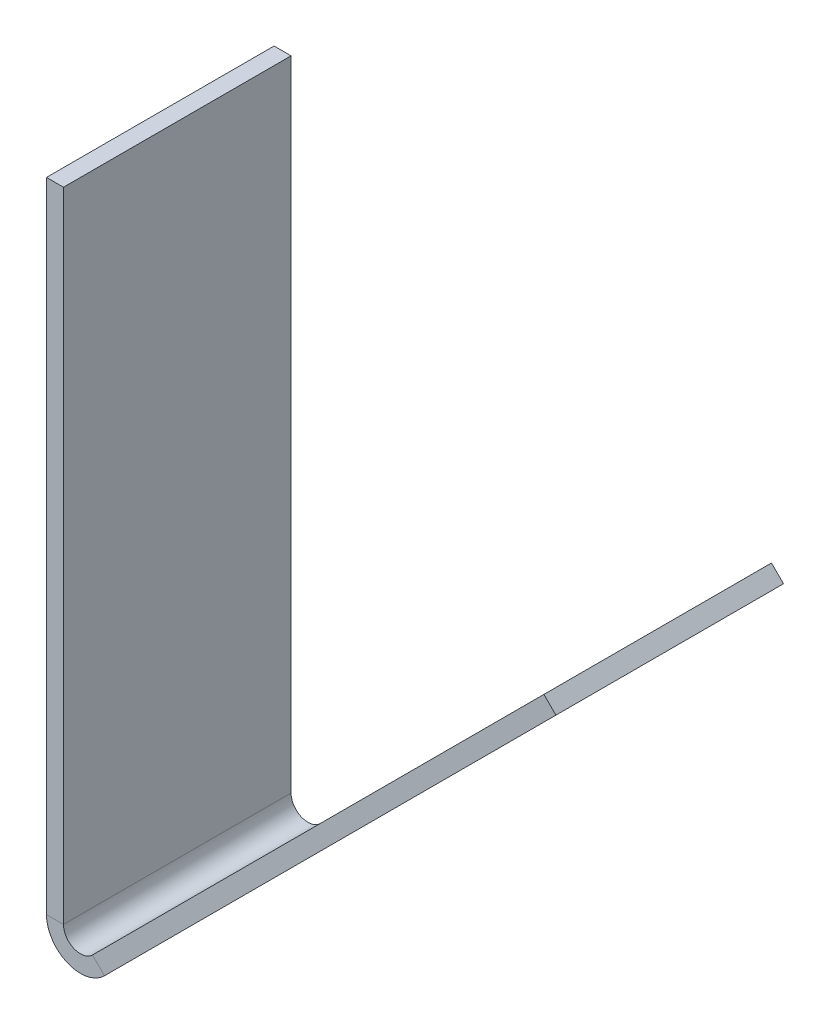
ISO-10303-21;
HEADER;
FILE_DESCRIPTION(('STEP AP214'),'2;1');
FILE_NAME('part.step','',(''),(''),'','','');
FILE_SCHEMA(('AUTOMOTIVE_DESIGN { 1 0 10303 214 1 1 1 1 }'));
ENDSEC;
DATA;
#1=APPLICATION_CONTEXT('core data for automotive mechanical design processes');
#2=APPLICATION_PROTOCOL_DEFINITION('international standard','automotive_design',2000,#1);
#3=PRODUCT_CONTEXT('',#1,'mechanical');
#4=PRODUCT('Part','Part','',(#3));
#5=PRODUCT_RELATED_PRODUCT_CATEGORY('part','',(#4));
#6=PRODUCT_DEFINITION_FORMATION('','',#4);
#7=PRODUCT_DEFINITION_CONTEXT('part definition',#1,'design');
#8=PRODUCT_DEFINITION('design','',#6,#7);
#9=PRODUCT_DEFINITION_SHAPE('','',#8);
#10=(LENGTH_UNIT() NAMED_UNIT(*) SI_UNIT(.MILLI.,.METRE.));
#11=(NAMED_UNIT(*) PLANE_ANGLE_UNIT() SI_UNIT($,.RADIAN.));
#12=(NAMED_UNIT(*) SI_UNIT($,.STERADIAN.) SOLID_ANGLE_UNIT());
#13=UNCERTAINTY_MEASURE_WITH_UNIT(LENGTH_MEASURE(1.E-05),#10,'distance_accuracy_value','');
#14=(GEOMETRIC_REPRESENTATION_CONTEXT(3) GLOBAL_UNCERTAINTY_ASSIGNED_CONTEXT((#13)) GLOBAL_UNIT_ASSIGNED_CONTEXT((#10,
#11,#12)) REPRESENTATION_CONTEXT('',''));
#15=CARTESIAN_POINT('',(0.,0.,0.));
#16=DIRECTION('',(0.,0.,1.));
#17=DIRECTION('',(1.,0.,0.));
#18=AXIS2_PLACEMENT_3D('',#15,#16,#17);
#19=CARTESIAN_POINT('',(4.26776695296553,4.26776695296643,33.4999999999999));
#20=DIRECTION('',(0.,0.,0.999999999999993));
#21=DIRECTION('',(0.999999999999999,0.,0.));
#22=AXIS2_PLACEMENT_3D('',#19,#20,#21);
#23=PLANE('',#22);
#24=DIRECTION('',(0.707106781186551,-0.707106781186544,0.));
#25=VECTOR('',#24,1.);
#26=CARTESIAN_POINT('',(4.26776695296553,4.26776695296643,33.4999999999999));
#27=LINE('',#26,#25);
#28=CARTESIAN_POINT('',(4.26776695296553,4.26776695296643,33.4999999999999));
#29=VERTEX_POINT('',#28);
#30=CARTESIAN_POINT('',(6.03553390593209,2.50000000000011,33.4999999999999));
#31=VERTEX_POINT('',#30);
#32=EDGE_CURVE('E11',#29,#31,#27,.T.);
#33=ORIENTED_EDGE('',*,*,#32,.F.);
#34=CARTESIAN_POINT('',(2.49999999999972,6.03553390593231,33.4999999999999));
#35=DIRECTION('',(0.,0.,-0.999999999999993));
#36=DIRECTION('',(-0.999999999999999,0.,0.));
#37=AXIS2_PLACEMENT_3D('',#34,#35,#36);
#38=CIRCLE('',#37,2.5);
#39=CARTESIAN_POINT('',(0.,6.03553390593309,33.4999999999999));
#40=VERTEX_POINT('',#39);
#41=EDGE_CURVE('E161',#40,#29,#38,.F.);
#42=ORIENTED_EDGE('',*,*,#41,.F.);
#43=DIRECTION('',(0.999999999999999,0.,0.));
#44=VECTOR('',#43,1.);
#45=CARTESIAN_POINT('',(-2.50000000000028,6.03553390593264,33.4999999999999));
#46=LINE('',#45,#44);
#47=CARTESIAN_POINT('',(-2.50000000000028,6.03553390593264,33.4999999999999));
#48=VERTEX_POINT('',#47);
#49=EDGE_CURVE('E46',#48,#40,#46,.T.);
#50=ORIENTED_EDGE('',*,*,#49,.F.);
#51=CARTESIAN_POINT('',(2.49999999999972,6.03553390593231,33.4999999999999));
#52=DIRECTION('',(0.,0.,0.999999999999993));
#53=DIRECTION('',(0.999999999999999,0.,0.));
#54=AXIS2_PLACEMENT_3D('',#51,#52,#53);
#55=CIRCLE('',#54,5.);
#56=EDGE_CURVE('E176',#48,#31,#55,.T.);
#57=ORIENTED_EDGE('',*,*,#56,.T.);
#58=EDGE_LOOP('',(#33,#42,#50,#57));
#59=FACE_BOUND('',#58,.T.);
#60=ADVANCED_FACE('F38',(#59),#23,.T.);
#61=CARTESIAN_POINT('',(-2.50000000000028,6.03553390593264,33.4999999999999));
#62=DIRECTION('',(0.,0.,0.999999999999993));
#63=DIRECTION('',(0.999999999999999,0.,0.));
#64=AXIS2_PLACEMENT_3D('',#61,#62,#63);
#65=PLANE('',#64);
#66=DIRECTION('',(0.707106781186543,0.707106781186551,0.));
#67=VECTOR('',#66,1.);
#68=CARTESIAN_POINT('',(0.,0.,33.4999999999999));
#69=LINE('',#68,#67);
#70=CARTESIAN_POINT('',(70.7106781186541,70.7106781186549,33.4999999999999));
#71=VERTEX_POINT('',#70);
#72=EDGE_CURVE('E157',#29,#71,#69,.T.);
#73=ORIENTED_EDGE('',*,*,#72,.F.);
#74=ORIENTED_EDGE('',*,*,#32,.T.);
#75=DIRECTION('',(0.707106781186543,0.707106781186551,0.));
#76=VECTOR('',#75,1.);
#77=CARTESIAN_POINT('',(1.7677669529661,-1.76776695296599,33.4999999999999));
#78=LINE('',#77,#76);
#79=CARTESIAN_POINT('',(72.4784450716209,68.9429111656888,33.4999999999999));
#80=VERTEX_POINT('',#79);
#81=EDGE_CURVE('E153',#31,#80,#78,.T.);
#82=ORIENTED_EDGE('',*,*,#81,.T.);
#83=DIRECTION('',(0.707106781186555,-0.707106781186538,0.));
#84=VECTOR('',#83,1.);
#85=CARTESIAN_POINT('',(70.7106781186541,70.7106781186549,33.4999999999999));
#86=LINE('',#85,#84);
#87=EDGE_CURVE('E108',#71,#80,#86,.T.);
#88=ORIENTED_EDGE('',*,*,#87,.F.);
#89=EDGE_LOOP('',(#73,#74,#82,#88));
#90=FACE_BOUND('',#89,.T.);
#91=ADVANCED_FACE('F230',(#90),#65,.T.);
#92=CARTESIAN_POINT('',(0.,6.0355339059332,0.));
#93=DIRECTION('',(0.,0.,-0.999999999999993));
#94=DIRECTION('',(-0.999999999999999,0.,0.));
#95=AXIS2_PLACEMENT_3D('',#92,#93,#94);
#96=PLANE('',#95);
#97=DIRECTION('',(-0.999999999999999,0.,0.));
#98=VECTOR('',#97,1.);
#99=CARTESIAN_POINT('',(0.,6.0355339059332,0.));
#100=LINE('',#99,#98);
#101=CARTESIAN_POINT('',(0.,6.0355339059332,0.));
#102=VERTEX_POINT('',#101);
#103=CARTESIAN_POINT('',(-2.50000000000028,6.03553390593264,0.));
#104=VERTEX_POINT('',#103);
#105=EDGE_CURVE('E203',#102,#104,#100,.T.);
#106=ORIENTED_EDGE('',*,*,#105,.F.);
#107=CARTESIAN_POINT('',(2.49999999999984,6.03553390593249,0.));
#108=DIRECTION('',(0.,0.,-0.999999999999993));
#109=DIRECTION('',(-0.999999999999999,0.,0.));
#110=AXIS2_PLACEMENT_3D('',#107,#108,#109);
#111=CIRCLE('',#110,2.5);
#112=CARTESIAN_POINT('',(4.26776695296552,4.26776695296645,0.));
#113=VERTEX_POINT('',#112);
#114=EDGE_CURVE('E131',#102,#113,#111,.F.);
#115=ORIENTED_EDGE('',*,*,#114,.T.);
#116=DIRECTION('',(-0.707106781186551,0.707106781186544,0.));
#117=VECTOR('',#116,1.);
#118=CARTESIAN_POINT('',(6.03553390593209,2.50000000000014,0.));
#119=LINE('',#118,#117);
#120=CARTESIAN_POINT('',(6.03553390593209,2.50000000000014,0.));
#121=VERTEX_POINT('',#120);
#122=EDGE_CURVE('E112',#121,#113,#119,.T.);
#123=ORIENTED_EDGE('',*,*,#122,.F.);
#124=CARTESIAN_POINT('',(2.49999999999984,6.03553390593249,0.));
#125=DIRECTION('',(0.,0.,0.999999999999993));
#126=DIRECTION('',(0.999999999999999,0.,0.));
#127=AXIS2_PLACEMENT_3D('',#124,#125,#126);
#128=CIRCLE('',#127,5.);
#129=EDGE_CURVE('E149',#104,#121,#128,.T.);
#130=ORIENTED_EDGE('',*,*,#129,.F.);
#131=EDGE_LOOP('',(#106,#115,#123,#130));
#132=FACE_BOUND('',#131,.T.);
#133=ADVANCED_FACE('F234',(#132),#96,.T.);
#134=CARTESIAN_POINT('',(6.03553390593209,2.50000000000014,0.));
#135=DIRECTION('',(0.,0.,-0.999999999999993));
#136=DIRECTION('',(-0.999999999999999,0.,0.));
#137=AXIS2_PLACEMENT_3D('',#134,#135,#136);
#138=PLANE('',#137);
#139=DIRECTION('',(0.,-0.999999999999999,0.));
#140=VECTOR('',#139,1.);
#141=CARTESIAN_POINT('',(-5.13478148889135E-13,99.9999999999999,0.));
#142=LINE('',#141,#140);
#143=CARTESIAN_POINT('',(-5.13478148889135E-13,99.9999999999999,0.));
#144=VERTEX_POINT('',#143);
#145=EDGE_CURVE('E137',#144,#102,#142,.T.);
#146=ORIENTED_EDGE('',*,*,#145,.T.);
#147=ORIENTED_EDGE('',*,*,#105,.T.);
#148=DIRECTION('',(0.,-0.999999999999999,0.));
#149=VECTOR('',#148,1.);
#150=CARTESIAN_POINT('',(-2.50000000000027,100.,0.));
#151=LINE('',#150,#149);
#152=CARTESIAN_POINT('',(-2.50000000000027,100.,0.));
#153=VERTEX_POINT('',#152);
#154=EDGE_CURVE('E145',#153,#104,#151,.T.);
#155=ORIENTED_EDGE('',*,*,#154,.F.);
#156=DIRECTION('',(0.999999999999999,0.,0.));
#157=VECTOR('',#156,1.);
#158=CARTESIAN_POINT('',(-2.50000000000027,100.,0.));
#159=LINE('',#158,#157);
#160=EDGE_CURVE('E141',#153,#144,#159,.T.);
#161=ORIENTED_EDGE('',*,*,#160,.T.);
#162=EDGE_LOOP('',(#146,#147,#155,#161));
#163=FACE_BOUND('',#162,.T.);
#164=ADVANCED_FACE('F236',(#163),#138,.T.);
#165=CARTESIAN_POINT('',(1.7677669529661,-1.76776695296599,33.4999999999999));
#166=DIRECTION('',(-0.707106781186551,0.707106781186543,0.));
#167=DIRECTION('',(-0.707106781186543,-0.707106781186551,0.));
#168=AXIS2_PLACEMENT_3D('',#165,#166,#167);
#169=PLANE('',#168);
#170=DIRECTION('',(0.707106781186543,0.707106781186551,0.));
#171=VECTOR('',#170,1.);
#172=CARTESIAN_POINT('',(1.76776695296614,-1.76776695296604,0.));
#173=LINE('',#172,#171);
#174=CARTESIAN_POINT('',(72.4784450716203,68.9429111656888,0.));
#175=VERTEX_POINT('',#174);
#176=EDGE_CURVE('E117',#121,#175,#173,.T.);
#177=ORIENTED_EDGE('',*,*,#176,.T.);
#178=DIRECTION('',(0.,0.,-0.999999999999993));
#179=VECTOR('',#178,1.);
#180=CARTESIAN_POINT('',(72.4784450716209,68.9429111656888,33.4999999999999));
#181=LINE('',#180,#179);
#182=EDGE_CURVE('E101',#80,#175,#181,.T.);
#183=ORIENTED_EDGE('',*,*,#182,.F.);
#184=ORIENTED_EDGE('',*,*,#81,.F.);
#185=DIRECTION('',(0.,0.,-0.999999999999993));
#186=VECTOR('',#185,1.);
#187=CARTESIAN_POINT('',(6.03553390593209,2.50000000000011,33.4999999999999));
#188=LINE('',#187,#186);
#189=EDGE_CURVE('E120',#31,#121,#188,.T.);
#190=ORIENTED_EDGE('',*,*,#189,.T.);
#191=EDGE_LOOP('',(#177,#183,#184,#190));
#192=FACE_BOUND('',#191,.T.);
#193=ADVANCED_FACE('F118',(#192),#169,.F.);
#194=CARTESIAN_POINT('',(70.7106781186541,70.7106781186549,33.4999999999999));
#195=DIRECTION('',(0.707106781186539,0.707106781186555,0.));
#196=DIRECTION('',(-0.707106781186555,0.707106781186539,0.));
#197=AXIS2_PLACEMENT_3D('',#194,#195,#196);
#198=PLANE('',#197);
#199=DIRECTION('',(0.707106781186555,-0.707106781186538,0.));
#200=VECTOR('',#199,1.);
#201=CARTESIAN_POINT('',(70.7106781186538,70.7106781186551,0.));
#202=LINE('',#201,#200);
#203=CARTESIAN_POINT('',(70.7106781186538,70.7106781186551,0.));
#204=VERTEX_POINT('',#203);
#205=EDGE_CURVE('E105',#204,#175,#202,.T.);
#206=ORIENTED_EDGE('',*,*,#205,.F.);
#207=DIRECTION('',(0.,0.,-0.999999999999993));
#208=VECTOR('',#207,1.);
#209=CARTESIAN_POINT('',(70.7106781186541,70.7106781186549,33.4999999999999));
#210=LINE('',#209,#208);
#211=EDGE_CURVE('E113',#71,#204,#210,.T.);
#212=ORIENTED_EDGE('',*,*,#211,.F.);
#213=ORIENTED_EDGE('',*,*,#87,.T.);
#214=ORIENTED_EDGE('',*,*,#182,.T.);
#215=EDGE_LOOP('',(#206,#212,#213,#214));
#216=FACE_BOUND('',#215,.T.);
#217=ADVANCED_FACE('F103',(#216),#198,.T.);
#218=CARTESIAN_POINT('',(0.,0.,33.4999999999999));
#219=DIRECTION('',(-0.707106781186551,0.707106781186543,0.));
#220=DIRECTION('',(-0.707106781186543,-0.707106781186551,0.));
#221=AXIS2_PLACEMENT_3D('',#218,#219,#220);
#222=PLANE('',#221);
#223=DIRECTION('',(0.707106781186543,0.707106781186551,0.));
#224=VECTOR('',#223,1.);
#225=CARTESIAN_POINT('',(0.,0.,0.));
#226=LINE('',#225,#224);
#227=EDGE_CURVE('E126',#113,#204,#226,.T.);
#228=ORIENTED_EDGE('',*,*,#227,.F.);
#229=DIRECTION('',(0.,0.,-0.999999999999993));
#230=VECTOR('',#229,1.);
#231=CARTESIAN_POINT('',(4.26776695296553,4.26776695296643,33.4999999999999));
#232=LINE('',#231,#230);
#233=EDGE_CURVE('E195',#29,#113,#232,.T.);
#234=ORIENTED_EDGE('',*,*,#233,.F.);
#235=ORIENTED_EDGE('',*,*,#72,.T.);
#236=ORIENTED_EDGE('',*,*,#211,.T.);
#237=EDGE_LOOP('',(#228,#234,#235,#236));
#238=FACE_BOUND('',#237,.T.);
#239=ADVANCED_FACE('F232',(#238),#222,.T.);
#240=CARTESIAN_POINT('',(2.49999999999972,6.03553390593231,33.4999999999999));
#241=DIRECTION('',(0.,0.,-0.999999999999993));
#242=DIRECTION('',(-0.999999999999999,0.,0.));
#243=AXIS2_PLACEMENT_3D('',#240,#241,#242);
#244=CYLINDRICAL_SURFACE('',#243,2.5);
#245=ORIENTED_EDGE('',*,*,#114,.F.);
#246=DIRECTION('',(0.,0.,-0.999999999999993));
#247=VECTOR('',#246,1.);
#248=CARTESIAN_POINT('',(0.,6.03553390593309,33.4999999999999));
#249=LINE('',#248,#247);
#250=EDGE_CURVE('E191',#40,#102,#249,.T.);
#251=ORIENTED_EDGE('',*,*,#250,.F.);
#252=ORIENTED_EDGE('',*,*,#41,.T.);
#253=ORIENTED_EDGE('',*,*,#233,.T.);
#254=EDGE_LOOP('',(#245,#251,#252,#253));
#255=FACE_BOUND('',#254,.T.);
#256=ADVANCED_FACE('F215',(#255),#244,.F.);
#257=CARTESIAN_POINT('',(-2.77555756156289E-13,99.9999999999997,33.4999999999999));
#258=DIRECTION('',(0.999999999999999,0.,0.));
#259=DIRECTION('',(0.,0.999999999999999,0.));
#260=AXIS2_PLACEMENT_3D('',#257,#258,#259);
#261=PLANE('',#260);
#262=ORIENTED_EDGE('',*,*,#145,.F.);
#263=DIRECTION('',(0.,0.,-0.999999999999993));
#264=VECTOR('',#263,1.);
#265=CARTESIAN_POINT('',(-2.77555756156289E-13,99.9999999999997,33.4999999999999));
#266=LINE('',#265,#264);
#267=CARTESIAN_POINT('',(-2.77555756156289E-13,99.9999999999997,33.4999999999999));
#268=VERTEX_POINT('',#267);
#269=EDGE_CURVE('E188',#268,#144,#266,.T.);
#270=ORIENTED_EDGE('',*,*,#269,.F.);
#271=DIRECTION('',(0.,-0.999999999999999,0.));
#272=VECTOR('',#271,1.);
#273=CARTESIAN_POINT('',(-2.77555756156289E-13,99.9999999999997,33.4999999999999));
#274=LINE('',#273,#272);
#275=EDGE_CURVE('E165',#268,#40,#274,.T.);
#276=ORIENTED_EDGE('',*,*,#275,.T.);
#277=ORIENTED_EDGE('',*,*,#250,.T.);
#278=EDGE_LOOP('',(#262,#270,#276,#277));
#279=FACE_BOUND('',#278,.T.);
#280=ADVANCED_FACE('F219',(#279),#261,.T.);
#281=CARTESIAN_POINT('',(-2.49999999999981,99.9999999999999,33.4999999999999));
#282=DIRECTION('',(0.,0.999999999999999,0.));
#283=DIRECTION('',(0.,0.,0.999999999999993));
#284=AXIS2_PLACEMENT_3D('',#281,#282,#283);
#285=PLANE('',#284);
#286=ORIENTED_EDGE('',*,*,#160,.F.);
#287=DIRECTION('',(0.,0.,-0.999999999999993));
#288=VECTOR('',#287,1.);
#289=CARTESIAN_POINT('',(-2.49999999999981,99.9999999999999,33.4999999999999));
#290=LINE('',#289,#288);
#291=CARTESIAN_POINT('',(-2.49999999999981,99.9999999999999,33.4999999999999));
#292=VERTEX_POINT('',#291);
#293=EDGE_CURVE('E185',#292,#153,#290,.T.);
#294=ORIENTED_EDGE('',*,*,#293,.F.);
#295=DIRECTION('',(0.999999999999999,0.,0.));
#296=VECTOR('',#295,1.);
#297=CARTESIAN_POINT('',(-2.49999999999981,99.9999999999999,33.4999999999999));
#298=LINE('',#297,#296);
#299=EDGE_CURVE('E169',#292,#268,#298,.T.);
#300=ORIENTED_EDGE('',*,*,#299,.T.);
#301=ORIENTED_EDGE('',*,*,#269,.T.);
#302=EDGE_LOOP('',(#286,#294,#300,#301));
#303=FACE_BOUND('',#302,.T.);
#304=ADVANCED_FACE('F222',(#303),#285,.T.);
#305=CARTESIAN_POINT('',(-2.49999999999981,99.9999999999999,33.4999999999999));
#306=DIRECTION('',(0.999999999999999,0.,0.));
#307=DIRECTION('',(0.,0.999999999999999,0.));
#308=AXIS2_PLACEMENT_3D('',#305,#306,#307);
#309=PLANE('',#308);
#310=ORIENTED_EDGE('',*,*,#154,.T.);
#311=DIRECTION('',(0.,0.,-0.999999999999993));
#312=VECTOR('',#311,1.);
#313=CARTESIAN_POINT('',(-2.50000000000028,6.03553390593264,33.4999999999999));
#314=LINE('',#313,#312);
#315=EDGE_CURVE('E181',#48,#104,#314,.T.);
#316=ORIENTED_EDGE('',*,*,#315,.F.);
#317=DIRECTION('',(0.,-0.999999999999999,0.));
#318=VECTOR('',#317,1.);
#319=CARTESIAN_POINT('',(-2.49999999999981,99.9999999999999,33.4999999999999));
#320=LINE('',#319,#318);
#321=EDGE_CURVE('E173',#292,#48,#320,.T.);
#322=ORIENTED_EDGE('',*,*,#321,.F.);
#323=ORIENTED_EDGE('',*,*,#293,.T.);
#324=EDGE_LOOP('',(#310,#316,#322,#323));
#325=FACE_BOUND('',#324,.T.);
#326=ADVANCED_FACE('F225',(#325),#309,.F.);
#327=CARTESIAN_POINT('',(2.49999999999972,6.03553390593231,33.4999999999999));
#328=DIRECTION('',(0.,0.,-0.999999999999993));
#329=DIRECTION('',(-0.999999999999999,0.,0.));
#330=AXIS2_PLACEMENT_3D('',#327,#328,#329);
#331=CYLINDRICAL_SURFACE('',#330,5.);
#332=ORIENTED_EDGE('',*,*,#129,.T.);
#333=ORIENTED_EDGE('',*,*,#189,.F.);
#334=ORIENTED_EDGE('',*,*,#56,.F.);
#335=ORIENTED_EDGE('',*,*,#315,.T.);
#336=EDGE_LOOP('',(#332,#333,#334,#335));
#337=FACE_BOUND('',#336,.T.);
#338=ADVANCED_FACE('F229',(#337),#331,.T.);
#339=CARTESIAN_POINT('',(2.49999999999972,6.03553390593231,33.4999999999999));
#340=DIRECTION('',(0.,0.,-0.999999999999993));
#341=DIRECTION('',(-0.999999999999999,0.,0.));
#342=AXIS2_PLACEMENT_3D('',#339,#340,#341);
#343=PLANE('',#342);
#344=ORIENTED_EDGE('',*,*,#321,.T.);
#345=ORIENTED_EDGE('',*,*,#49,.T.);
#346=ORIENTED_EDGE('',*,*,#275,.F.);
#347=ORIENTED_EDGE('',*,*,#299,.F.);
#348=EDGE_LOOP('',(#344,#345,#346,#347));
#349=FACE_BOUND('',#348,.T.);
#350=ADVANCED_FACE('F209',(#349),#343,.F.);
#351=CARTESIAN_POINT('',(2.49999999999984,6.03553390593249,0.));
#352=DIRECTION('',(0.,0.,-0.999999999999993));
#353=DIRECTION('',(-0.999999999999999,0.,0.));
#354=AXIS2_PLACEMENT_3D('',#351,#352,#353);
#355=PLANE('',#354);
#356=ORIENTED_EDGE('',*,*,#176,.F.);
#357=ORIENTED_EDGE('',*,*,#122,.T.);
#358=ORIENTED_EDGE('',*,*,#227,.T.);
#359=ORIENTED_EDGE('',*,*,#205,.T.);
#360=EDGE_LOOP('',(#356,#357,#358,#359));
#361=FACE_BOUND('',#360,.T.);
#362=ADVANCED_FACE('F124',(#361),#355,.T.);
#363=CLOSED_SHELL('',(#60,#91,#133,#164,#193,#217,#239,#256,#280,#304,#326,#338,#350,#362));
#364=MANIFOLD_SOLID_BREP('B2',#363);
#365=ADVANCED_BREP_SHAPE_REPRESENTATION('',(#18,#364),#14);
#366=SHAPE_DEFINITION_REPRESENTATION(#9,#365);
ENDSEC;
END-ISO-10303-21;
